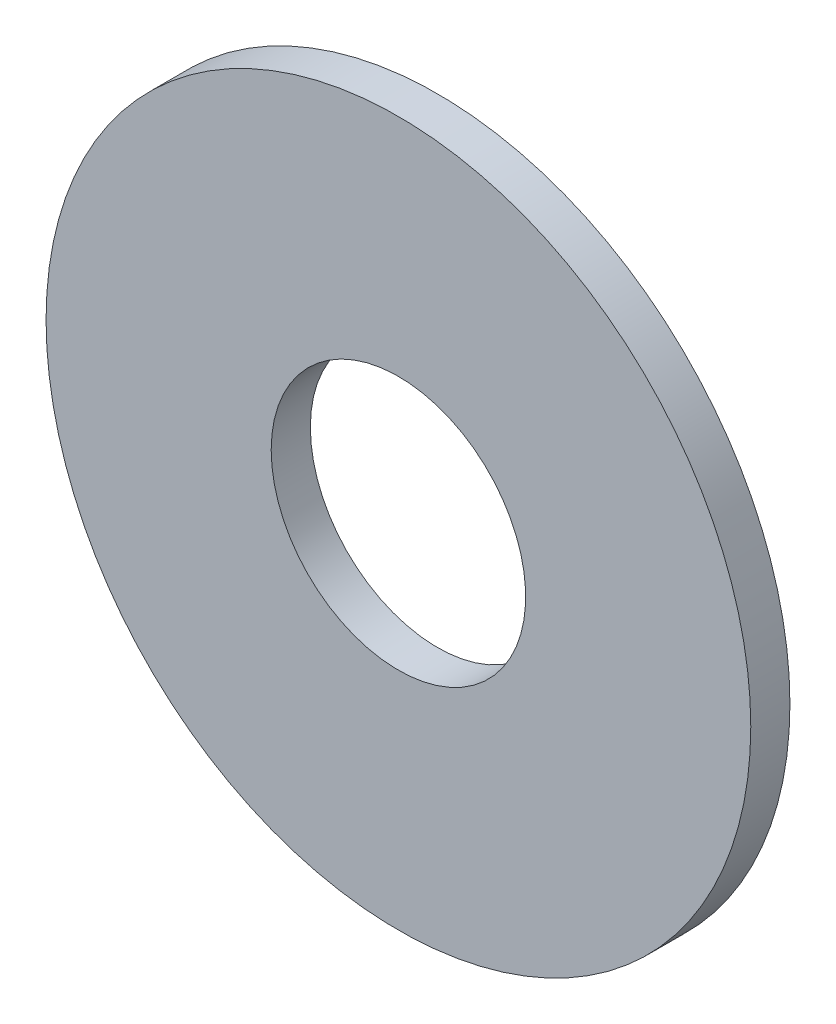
ISO-10303-21;
HEADER;
FILE_DESCRIPTION(('STEP AP214'),'2;1');
FILE_NAME('part.step','',(''),(''),'','','');
FILE_SCHEMA(('AUTOMOTIVE_DESIGN { 1 0 10303 214 1 1 1 1 }'));
ENDSEC;
DATA;
#1=APPLICATION_CONTEXT('core data for automotive mechanical design processes');
#2=APPLICATION_PROTOCOL_DEFINITION('international standard','automotive_design',2000,#1);
#3=PRODUCT_CONTEXT('',#1,'mechanical');
#4=PRODUCT('Part','Part','',(#3));
#5=PRODUCT_RELATED_PRODUCT_CATEGORY('part','',(#4));
#6=PRODUCT_DEFINITION_FORMATION('','',#4);
#7=PRODUCT_DEFINITION_CONTEXT('part definition',#1,'design');
#8=PRODUCT_DEFINITION('design','',#6,#7);
#9=PRODUCT_DEFINITION_SHAPE('','',#8);
#10=(LENGTH_UNIT() NAMED_UNIT(*) SI_UNIT(.MILLI.,.METRE.));
#11=(NAMED_UNIT(*) PLANE_ANGLE_UNIT() SI_UNIT($,.RADIAN.));
#12=(NAMED_UNIT(*) SI_UNIT($,.STERADIAN.) SOLID_ANGLE_UNIT());
#13=UNCERTAINTY_MEASURE_WITH_UNIT(LENGTH_MEASURE(1.E-05),#10,'distance_accuracy_value','');
#14=(GEOMETRIC_REPRESENTATION_CONTEXT(3) GLOBAL_UNCERTAINTY_ASSIGNED_CONTEXT((#13)) GLOBAL_UNIT_ASSIGNED_CONTEXT((#10,
#11,#12)) REPRESENTATION_CONTEXT('',''));
#15=CARTESIAN_POINT('',(0.,0.,0.));
#16=DIRECTION('',(0.,0.,1.));
#17=DIRECTION('',(1.,0.,0.));
#18=AXIS2_PLACEMENT_3D('',#15,#16,#17);
#19=CARTESIAN_POINT('',(-10.0000000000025,-20.0000000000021,1.000000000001));
#20=DIRECTION('',(0.,0.,0.99999999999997));
#21=DIRECTION('',(0.999999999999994,0.,0.));
#22=AXIS2_PLACEMENT_3D('',#19,#20,#21);
#23=PLANE('',#22);
#24=CARTESIAN_POINT('',(-10.0000000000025,-20.0000000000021,1.000000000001));
#25=DIRECTION('',(0.,0.,0.99999999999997));
#26=DIRECTION('',(0.999999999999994,0.,0.));
#27=AXIS2_PLACEMENT_3D('',#24,#25,#26);
#28=CIRCLE('',#27,9.);
#29=CARTESIAN_POINT('',(-19.0000000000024,-20.0000000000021,1.000000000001));
#30=VERTEX_POINT('',#29);
#31=EDGE_CURVE('E10',#30,#30,#28,.T.);
#32=ORIENTED_EDGE('',*,*,#31,.T.);
#33=EDGE_LOOP('',(#32));
#34=FACE_BOUND('',#33,.T.);
#35=CARTESIAN_POINT('',(-10.0000000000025,-20.0000000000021,1.000000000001));
#36=DIRECTION('',(0.,0.,0.99999999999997));
#37=DIRECTION('',(0.999999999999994,0.,0.));
#38=AXIS2_PLACEMENT_3D('',#35,#36,#37);
#39=CIRCLE('',#38,3.25);
#40=CARTESIAN_POINT('',(-13.2500000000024,-20.0000000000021,1.000000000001));
#41=VERTEX_POINT('',#40);
#42=EDGE_CURVE('E54',#41,#41,#39,.T.);
#43=ORIENTED_EDGE('',*,*,#42,.F.);
#44=EDGE_LOOP('',(#43));
#45=FACE_BOUND('',#44,.T.);
#46=ADVANCED_FACE('F38',(#34,#45),#23,.T.);
#47=CARTESIAN_POINT('',(-10.0000000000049,-20.0000000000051,4.44089209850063E-13));
#48=DIRECTION('',(0.,0.,0.99999999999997));
#49=DIRECTION('',(0.999999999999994,0.,0.));
#50=AXIS2_PLACEMENT_3D('',#47,#48,#49);
#51=PLANE('',#50);
#52=CARTESIAN_POINT('',(-10.0000000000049,-20.0000000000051,4.44089209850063E-13));
#53=DIRECTION('',(0.,0.,0.99999999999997));
#54=DIRECTION('',(0.999999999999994,0.,0.));
#55=AXIS2_PLACEMENT_3D('',#52,#53,#54);
#56=CIRCLE('',#55,9.);
#57=CARTESIAN_POINT('',(-19.0000000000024,-20.0000000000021,4.46040773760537E-13));
#58=VERTEX_POINT('',#57);
#59=EDGE_CURVE('E42',#58,#58,#56,.T.);
#60=ORIENTED_EDGE('',*,*,#59,.F.);
#61=EDGE_LOOP('',(#60));
#62=FACE_BOUND('',#61,.T.);
#63=CARTESIAN_POINT('',(-10.0000000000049,-20.0000000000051,4.44089209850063E-13));
#64=DIRECTION('',(0.,0.,0.99999999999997));
#65=DIRECTION('',(0.999999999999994,0.,0.));
#66=AXIS2_PLACEMENT_3D('',#63,#64,#65);
#67=CIRCLE('',#66,3.25);
#68=CARTESIAN_POINT('',(-13.2500000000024,-20.0000000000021,4.44739731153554E-13));
#69=VERTEX_POINT('',#68);
#70=EDGE_CURVE('E56',#69,#69,#67,.T.);
#71=ORIENTED_EDGE('',*,*,#70,.T.);
#72=EDGE_LOOP('',(#71));
#73=FACE_BOUND('',#72,.T.);
#74=ADVANCED_FACE('F70',(#62,#73),#51,.F.);
#75=CARTESIAN_POINT('',(-10.0000000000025,-20.0000000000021,1.000000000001));
#76=DIRECTION('',(0.,0.,-0.99999999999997));
#77=DIRECTION('',(-0.999999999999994,0.,0.));
#78=AXIS2_PLACEMENT_3D('',#75,#76,#77);
#79=CYLINDRICAL_SURFACE('',#78,9.);
#80=CARTESIAN_POINT('',(-19.0000000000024,-20.0000000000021,1.000000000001));
#81=CARTESIAN_POINT('',(-19.0000000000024,-20.0000000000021,0.98958333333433));
#82=CARTESIAN_POINT('',(-19.0000000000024,-20.0000000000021,0.979166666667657));
#83=CARTESIAN_POINT('',(-19.0000000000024,-20.0000000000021,0.958333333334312));
#84=CARTESIAN_POINT('',(-19.0000000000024,-20.0000000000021,0.94791666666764));
#85=CARTESIAN_POINT('',(-19.0000000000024,-20.0000000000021,0.927083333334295));
#86=CARTESIAN_POINT('',(-19.0000000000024,-20.0000000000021,0.916666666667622));
#87=CARTESIAN_POINT('',(-19.0000000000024,-20.0000000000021,0.895833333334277));
#88=CARTESIAN_POINT('',(-19.0000000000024,-20.0000000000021,0.885416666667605));
#89=CARTESIAN_POINT('',(-19.0000000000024,-20.0000000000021,0.86458333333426));
#90=CARTESIAN_POINT('',(-19.0000000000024,-20.0000000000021,0.854166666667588));
#91=CARTESIAN_POINT('',(-19.0000000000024,-20.0000000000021,0.833333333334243));
#92=CARTESIAN_POINT('',(-19.0000000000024,-20.0000000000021,0.82291666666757));
#93=CARTESIAN_POINT('',(-19.0000000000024,-20.0000000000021,0.802083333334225));
#94=CARTESIAN_POINT('',(-19.0000000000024,-20.0000000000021,0.791666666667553));
#95=CARTESIAN_POINT('',(-19.0000000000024,-20.0000000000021,0.770833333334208));
#96=CARTESIAN_POINT('',(-19.0000000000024,-20.0000000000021,0.760416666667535));
#97=CARTESIAN_POINT('',(-19.0000000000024,-20.0000000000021,0.73958333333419));
#98=CARTESIAN_POINT('',(-19.0000000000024,-20.0000000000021,0.729166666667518));
#99=CARTESIAN_POINT('',(-19.0000000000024,-20.0000000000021,0.708333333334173));
#100=CARTESIAN_POINT('',(-19.0000000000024,-20.0000000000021,0.697916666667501));
#101=CARTESIAN_POINT('',(-19.0000000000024,-20.0000000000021,0.677083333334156));
#102=CARTESIAN_POINT('',(-19.0000000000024,-20.0000000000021,0.666666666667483));
#103=CARTESIAN_POINT('',(-19.0000000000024,-20.0000000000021,0.645833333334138));
#104=CARTESIAN_POINT('',(-19.0000000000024,-20.0000000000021,0.635416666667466));
#105=CARTESIAN_POINT('',(-19.0000000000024,-20.0000000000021,0.614583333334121));
#106=CARTESIAN_POINT('',(-19.0000000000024,-20.0000000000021,0.604166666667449));
#107=CARTESIAN_POINT('',(-19.0000000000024,-20.0000000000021,0.583333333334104));
#108=CARTESIAN_POINT('',(-19.0000000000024,-20.0000000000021,0.572916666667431));
#109=CARTESIAN_POINT('',(-19.0000000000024,-20.0000000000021,0.552083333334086));
#110=CARTESIAN_POINT('',(-19.0000000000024,-20.0000000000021,0.541666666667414));
#111=CARTESIAN_POINT('',(-19.0000000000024,-20.0000000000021,0.520833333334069));
#112=CARTESIAN_POINT('',(-19.0000000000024,-20.0000000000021,0.510416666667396));
#113=CARTESIAN_POINT('',(-19.0000000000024,-20.0000000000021,0.489583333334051));
#114=CARTESIAN_POINT('',(-19.0000000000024,-20.0000000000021,0.479166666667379));
#115=CARTESIAN_POINT('',(-19.0000000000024,-20.0000000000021,0.458333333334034));
#116=CARTESIAN_POINT('',(-19.0000000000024,-20.0000000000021,0.447916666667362));
#117=CARTESIAN_POINT('',(-19.0000000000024,-20.0000000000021,0.427083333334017));
#118=CARTESIAN_POINT('',(-19.0000000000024,-20.0000000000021,0.416666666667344));
#119=CARTESIAN_POINT('',(-19.0000000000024,-20.0000000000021,0.395833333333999));
#120=CARTESIAN_POINT('',(-19.0000000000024,-20.0000000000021,0.385416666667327));
#121=CARTESIAN_POINT('',(-19.0000000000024,-20.0000000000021,0.364583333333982));
#122=CARTESIAN_POINT('',(-19.0000000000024,-20.0000000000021,0.35416666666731));
#123=CARTESIAN_POINT('',(-19.0000000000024,-20.0000000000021,0.333333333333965));
#124=CARTESIAN_POINT('',(-19.0000000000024,-20.0000000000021,0.322916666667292));
#125=CARTESIAN_POINT('',(-19.0000000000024,-20.0000000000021,0.302083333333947));
#126=CARTESIAN_POINT('',(-19.0000000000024,-20.0000000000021,0.291666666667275));
#127=CARTESIAN_POINT('',(-19.0000000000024,-20.0000000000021,0.27083333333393));
#128=CARTESIAN_POINT('',(-19.0000000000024,-20.0000000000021,0.260416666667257));
#129=CARTESIAN_POINT('',(-19.0000000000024,-20.0000000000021,0.239583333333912));
#130=CARTESIAN_POINT('',(-19.0000000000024,-20.0000000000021,0.22916666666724));
#131=CARTESIAN_POINT('',(-19.0000000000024,-20.0000000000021,0.208333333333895));
#132=CARTESIAN_POINT('',(-19.0000000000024,-20.0000000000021,0.197916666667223));
#133=CARTESIAN_POINT('',(-19.0000000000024,-20.0000000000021,0.177083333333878));
#134=CARTESIAN_POINT('',(-19.0000000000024,-20.0000000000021,0.166666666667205));
#135=CARTESIAN_POINT('',(-19.0000000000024,-20.0000000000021,0.14583333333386));
#136=CARTESIAN_POINT('',(-19.0000000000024,-20.0000000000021,0.135416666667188));
#137=CARTESIAN_POINT('',(-19.0000000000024,-20.0000000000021,0.114583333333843));
#138=CARTESIAN_POINT('',(-19.0000000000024,-20.0000000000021,0.104166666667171));
#139=CARTESIAN_POINT('',(-19.0000000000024,-20.0000000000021,0.0833333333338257));
#140=CARTESIAN_POINT('',(-19.0000000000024,-20.0000000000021,0.0729166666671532));
#141=CARTESIAN_POINT('',(-19.0000000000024,-20.0000000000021,0.0520833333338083));
#142=CARTESIAN_POINT('',(-19.0000000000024,-20.0000000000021,0.0416666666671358));
#143=CARTESIAN_POINT('',(-19.0000000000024,-20.0000000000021,0.020833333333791));
#144=CARTESIAN_POINT('',(-19.0000000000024,-20.0000000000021,0.0104166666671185));
#145=CARTESIAN_POINT('',(-19.0000000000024,-20.0000000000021,4.46040773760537E-13));
#146=B_SPLINE_CURVE_WITH_KNOTS('',3,(#80,#81,#82,#83,#84,#85,#86,#87,#88,#89,#90,#91,#92,#93,
#94,#95,#96,#97,#98,#99,#100,#101,#102,#103,#104,#105,#106,#107,#108,#109,#110,#111,#112,#113,
#114,#115,#116,#117,#118,#119,#120,#121,#122,#123,#124,#125,#126,#127,#128,#129,#130,#131,#132,
#133,#134,#135,#136,#137,#138,#139,#140,#141,#142,#143,#144,#145),.UNSPECIFIED.,.F.,.F.,(4,2,2,
2,2,2,2,2,2,2,2,2,2,2,2,2,2,2,2,2,2,2,2,2,2,2,2,2,2,2,2,2,4),(0.,0.0312500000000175,
0.0625000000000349,0.0937500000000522,0.12500000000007,0.156250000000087,0.187500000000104,
0.218750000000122,0.250000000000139,0.281250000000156,0.312500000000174,0.343750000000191,
0.375000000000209,0.406250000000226,0.437500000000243,0.468750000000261,0.500000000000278,
0.531250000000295,0.562500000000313,0.59375000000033,0.625000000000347,0.656250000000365,
0.687500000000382,0.7187500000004,0.750000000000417,0.781250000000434,0.812500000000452,
0.843750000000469,0.875000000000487,0.906250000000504,0.937500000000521,0.968750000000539,
1.00000000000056),.UNSPECIFIED.);
#147=EDGE_CURVE('BSEAM40',#30,#58,#146,.T.);
#148=ORIENTED_EDGE('',*,*,#31,.F.);
#149=ORIENTED_EDGE('',*,*,#59,.T.);
#150=ORIENTED_EDGE('',*,*,#147,.T.);
#151=ORIENTED_EDGE('',*,*,#147,.F.);
#152=EDGE_LOOP('',(#148,#150,#149,#151));
#153=FACE_BOUND('',#152,.T.);
#154=ADVANCED_FACE('F40',(#153),#79,.T.);
#155=CARTESIAN_POINT('',(-10.0000000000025,-20.0000000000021,1.000000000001));
#156=DIRECTION('',(0.,0.,-0.99999999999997));
#157=DIRECTION('',(-0.999999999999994,0.,0.));
#158=AXIS2_PLACEMENT_3D('',#155,#156,#157);
#159=CYLINDRICAL_SURFACE('',#158,3.25);
#160=CARTESIAN_POINT('',(-13.2500000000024,-20.0000000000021,1.000000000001));
#161=CARTESIAN_POINT('',(-13.2500000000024,-20.0000000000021,0.989583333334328));
#162=CARTESIAN_POINT('',(-13.2500000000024,-20.0000000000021,0.979166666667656));
#163=CARTESIAN_POINT('',(-13.2500000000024,-20.0000000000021,0.958333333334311));
#164=CARTESIAN_POINT('',(-13.2500000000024,-20.0000000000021,0.947916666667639));
#165=CARTESIAN_POINT('',(-13.2500000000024,-20.0000000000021,0.927083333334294));
#166=CARTESIAN_POINT('',(-13.2500000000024,-20.0000000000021,0.916666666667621));
#167=CARTESIAN_POINT('',(-13.2500000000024,-20.0000000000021,0.895833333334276));
#168=CARTESIAN_POINT('',(-13.2500000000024,-20.0000000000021,0.885416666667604));
#169=CARTESIAN_POINT('',(-13.2500000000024,-20.0000000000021,0.864583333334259));
#170=CARTESIAN_POINT('',(-13.2500000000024,-20.0000000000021,0.854166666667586));
#171=CARTESIAN_POINT('',(-13.2500000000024,-20.0000000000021,0.833333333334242));
#172=CARTESIAN_POINT('',(-13.2500000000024,-20.0000000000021,0.822916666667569));
#173=CARTESIAN_POINT('',(-13.2500000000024,-20.0000000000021,0.802083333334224));
#174=CARTESIAN_POINT('',(-13.2500000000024,-20.0000000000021,0.791666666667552));
#175=CARTESIAN_POINT('',(-13.2500000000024,-20.0000000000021,0.770833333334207));
#176=CARTESIAN_POINT('',(-13.2500000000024,-20.0000000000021,0.760416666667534));
#177=CARTESIAN_POINT('',(-13.2500000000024,-20.0000000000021,0.739583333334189));
#178=CARTESIAN_POINT('',(-13.2500000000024,-20.0000000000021,0.729166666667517));
#179=CARTESIAN_POINT('',(-13.2500000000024,-20.0000000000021,0.708333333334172));
#180=CARTESIAN_POINT('',(-13.2500000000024,-20.0000000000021,0.697916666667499));
#181=CARTESIAN_POINT('',(-13.2500000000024,-20.0000000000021,0.677083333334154));
#182=CARTESIAN_POINT('',(-13.2500000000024,-20.0000000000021,0.666666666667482));
#183=CARTESIAN_POINT('',(-13.2500000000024,-20.0000000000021,0.645833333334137));
#184=CARTESIAN_POINT('',(-13.2500000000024,-20.0000000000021,0.635416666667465));
#185=CARTESIAN_POINT('',(-13.2500000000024,-20.0000000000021,0.61458333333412));
#186=CARTESIAN_POINT('',(-13.2500000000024,-20.0000000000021,0.604166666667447));
#187=CARTESIAN_POINT('',(-13.2500000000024,-20.0000000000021,0.583333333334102));
#188=CARTESIAN_POINT('',(-13.2500000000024,-20.0000000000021,0.57291666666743));
#189=CARTESIAN_POINT('',(-13.2500000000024,-20.0000000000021,0.552083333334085));
#190=CARTESIAN_POINT('',(-13.2500000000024,-20.0000000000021,0.541666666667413));
#191=CARTESIAN_POINT('',(-13.2500000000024,-20.0000000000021,0.520833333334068));
#192=CARTESIAN_POINT('',(-13.2500000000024,-20.0000000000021,0.510416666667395));
#193=CARTESIAN_POINT('',(-13.2500000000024,-20.0000000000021,0.48958333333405));
#194=CARTESIAN_POINT('',(-13.2500000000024,-20.0000000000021,0.479166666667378));
#195=CARTESIAN_POINT('',(-13.2500000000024,-20.0000000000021,0.458333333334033));
#196=CARTESIAN_POINT('',(-13.2500000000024,-20.0000000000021,0.447916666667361));
#197=CARTESIAN_POINT('',(-13.2500000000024,-20.0000000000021,0.427083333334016));
#198=CARTESIAN_POINT('',(-13.2500000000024,-20.0000000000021,0.416666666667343));
#199=CARTESIAN_POINT('',(-13.2500000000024,-20.0000000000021,0.395833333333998));
#200=CARTESIAN_POINT('',(-13.2500000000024,-20.0000000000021,0.385416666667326));
#201=CARTESIAN_POINT('',(-13.2500000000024,-20.0000000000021,0.364583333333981));
#202=CARTESIAN_POINT('',(-13.2500000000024,-20.0000000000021,0.354166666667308));
#203=CARTESIAN_POINT('',(-13.2500000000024,-20.0000000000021,0.333333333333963));
#204=CARTESIAN_POINT('',(-13.2500000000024,-20.0000000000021,0.322916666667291));
#205=CARTESIAN_POINT('',(-13.2500000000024,-20.0000000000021,0.302083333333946));
#206=CARTESIAN_POINT('',(-13.2500000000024,-20.0000000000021,0.291666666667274));
#207=CARTESIAN_POINT('',(-13.2500000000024,-20.0000000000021,0.270833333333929));
#208=CARTESIAN_POINT('',(-13.2500000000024,-20.0000000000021,0.260416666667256));
#209=CARTESIAN_POINT('',(-13.2500000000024,-20.0000000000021,0.239583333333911));
#210=CARTESIAN_POINT('',(-13.2500000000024,-20.0000000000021,0.229166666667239));
#211=CARTESIAN_POINT('',(-13.2500000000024,-20.0000000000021,0.208333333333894));
#212=CARTESIAN_POINT('',(-13.2500000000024,-20.0000000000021,0.197916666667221));
#213=CARTESIAN_POINT('',(-13.2500000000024,-20.0000000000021,0.177083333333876));
#214=CARTESIAN_POINT('',(-13.2500000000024,-20.0000000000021,0.166666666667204));
#215=CARTESIAN_POINT('',(-13.2500000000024,-20.0000000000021,0.145833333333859));
#216=CARTESIAN_POINT('',(-13.2500000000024,-20.0000000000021,0.135416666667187));
#217=CARTESIAN_POINT('',(-13.2500000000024,-20.0000000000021,0.114583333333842));
#218=CARTESIAN_POINT('',(-13.2500000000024,-20.0000000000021,0.104166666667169));
#219=CARTESIAN_POINT('',(-13.2500000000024,-20.0000000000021,0.0833333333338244));
#220=CARTESIAN_POINT('',(-13.2500000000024,-20.0000000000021,0.0729166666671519));
#221=CARTESIAN_POINT('',(-13.2500000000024,-20.0000000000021,0.052083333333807));
#222=CARTESIAN_POINT('',(-13.2500000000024,-20.0000000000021,0.0416666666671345));
#223=CARTESIAN_POINT('',(-13.2500000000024,-20.0000000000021,0.0208333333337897));
#224=CARTESIAN_POINT('',(-13.2500000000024,-20.0000000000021,0.0104166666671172));
#225=CARTESIAN_POINT('',(-13.2500000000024,-20.0000000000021,4.44739731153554E-13));
#226=B_SPLINE_CURVE_WITH_KNOTS('',3,(#160,#161,#162,#163,#164,#165,#166,#167,#168,#169,#170,
#171,#172,#173,#174,#175,#176,#177,#178,#179,#180,#181,#182,#183,#184,#185,#186,#187,#188,#189,
#190,#191,#192,#193,#194,#195,#196,#197,#198,#199,#200,#201,#202,#203,#204,#205,#206,#207,#208,
#209,#210,#211,#212,#213,#214,#215,#216,#217,#218,#219,#220,#221,#222,#223,#224,#225),
.UNSPECIFIED.,.F.,.F.,(4,2,2,2,2,2,2,2,2,2,2,2,2,2,2,2,2,2,2,2,2,2,2,2,2,2,2,2,2,2,2,2,4),(0.,
0.0312500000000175,0.0625000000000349,0.0937500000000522,0.12500000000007,0.156250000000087,
0.187500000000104,0.218750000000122,0.250000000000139,0.281250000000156,0.312500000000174,
0.343750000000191,0.375000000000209,0.406250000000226,0.437500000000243,0.468750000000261,
0.500000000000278,0.531250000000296,0.562500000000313,0.59375000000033,0.625000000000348,
0.656250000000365,0.687500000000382,0.7187500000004,0.750000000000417,0.781250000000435,
0.812500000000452,0.843750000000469,0.875000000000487,0.906250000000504,0.937500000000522,
0.968750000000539,1.00000000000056),.UNSPECIFIED.);
#227=EDGE_CURVE('BSEAM66',#41,#69,#226,.T.);
#228=ORIENTED_EDGE('',*,*,#42,.T.);
#229=ORIENTED_EDGE('',*,*,#70,.F.);
#230=ORIENTED_EDGE('',*,*,#227,.T.);
#231=ORIENTED_EDGE('',*,*,#227,.F.);
#232=EDGE_LOOP('',(#228,#230,#229,#231));
#233=FACE_BOUND('',#232,.T.);
#234=ADVANCED_FACE('F66',(#233),#159,.F.);
#235=CLOSED_SHELL('',(#46,#74,#154,#234));
#236=MANIFOLD_SOLID_BREP('B2',#235);
#237=ADVANCED_BREP_SHAPE_REPRESENTATION('',(#18,#236),#14);
#238=SHAPE_DEFINITION_REPRESENTATION(#9,#237);
ENDSEC;
END-ISO-10303-21;
